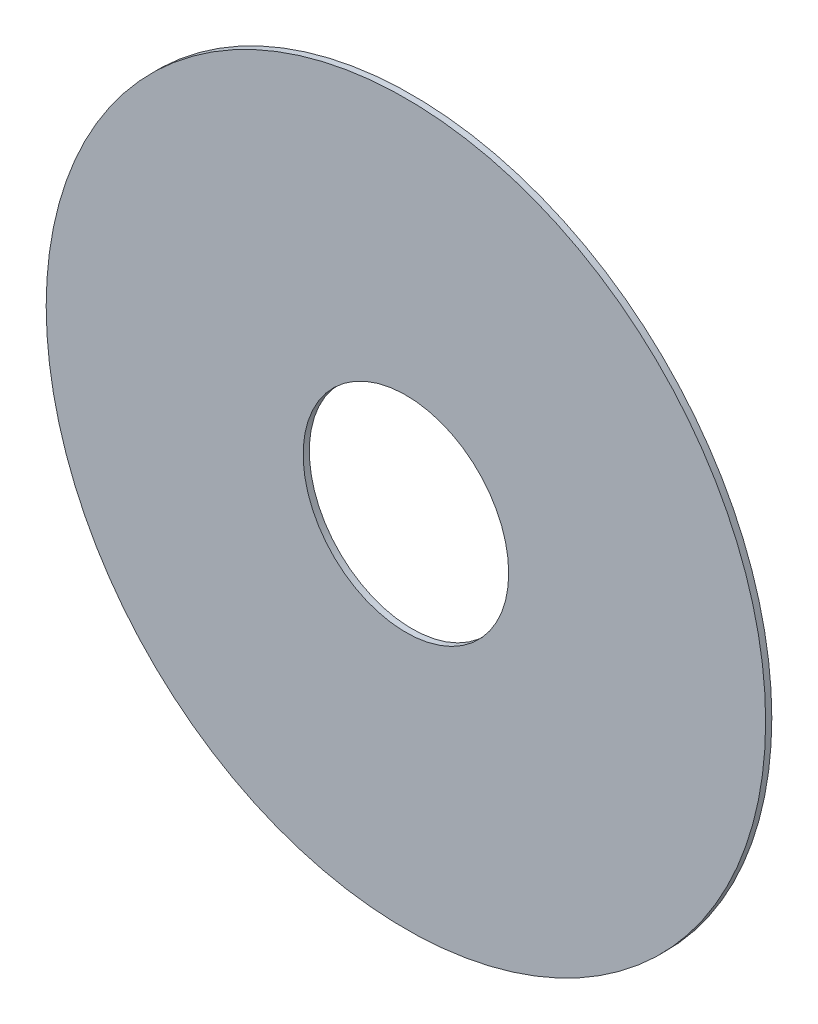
ISO-10303-21;
HEADER;
FILE_DESCRIPTION(('STEP AP214'),'2;1');
FILE_NAME('part.step','',(''),(''),'','','');
FILE_SCHEMA(('AUTOMOTIVE_DESIGN { 1 0 10303 214 1 1 1 1 }'));
ENDSEC;
DATA;
#1=APPLICATION_CONTEXT('core data for automotive mechanical design processes');
#2=APPLICATION_PROTOCOL_DEFINITION('international standard','automotive_design',2000,#1);
#3=PRODUCT_CONTEXT('',#1,'mechanical');
#4=PRODUCT('Part','Part','',(#3));
#5=PRODUCT_RELATED_PRODUCT_CATEGORY('part','',(#4));
#6=PRODUCT_DEFINITION_FORMATION('','',#4);
#7=PRODUCT_DEFINITION_CONTEXT('part definition',#1,'design');
#8=PRODUCT_DEFINITION('design','',#6,#7);
#9=PRODUCT_DEFINITION_SHAPE('','',#8);
#10=(LENGTH_UNIT() NAMED_UNIT(*) SI_UNIT(.MILLI.,.METRE.));
#11=(NAMED_UNIT(*) PLANE_ANGLE_UNIT() SI_UNIT($,.RADIAN.));
#12=(NAMED_UNIT(*) SI_UNIT($,.STERADIAN.) SOLID_ANGLE_UNIT());
#13=UNCERTAINTY_MEASURE_WITH_UNIT(LENGTH_MEASURE(1.E-05),#10,'distance_accuracy_value','');
#14=(GEOMETRIC_REPRESENTATION_CONTEXT(3) GLOBAL_UNCERTAINTY_ASSIGNED_CONTEXT((#13)) GLOBAL_UNIT_ASSIGNED_CONTEXT((#10,
#11,#12)) REPRESENTATION_CONTEXT('',''));
#15=CARTESIAN_POINT('',(0.,0.,0.));
#16=DIRECTION('',(0.,0.,1.));
#17=DIRECTION('',(1.,0.,0.));
#18=AXIS2_PLACEMENT_3D('',#15,#16,#17);
#19=CARTESIAN_POINT('',(0.,0.,1.524));
#20=DIRECTION('',(0.,0.,-1.));
#21=DIRECTION('',(-1.,0.,0.));
#22=AXIS2_PLACEMENT_3D('',#19,#20,#21);
#23=CYLINDRICAL_SURFACE('',#22,88.9);
#24=CARTESIAN_POINT('',(0.,0.,1.524));
#25=DIRECTION('',(0.,0.,1.));
#26=DIRECTION('',(1.,0.,0.));
#27=AXIS2_PLACEMENT_3D('',#24,#25,#26);
#28=CIRCLE('',#27,88.9);
#29=CARTESIAN_POINT('',(88.9,0.,1.524));
#30=VERTEX_POINT('',#29);
#31=EDGE_CURVE('E10',#30,#30,#28,.T.);
#32=ORIENTED_EDGE('',*,*,#31,.F.);
#33=EDGE_LOOP('',(#32));
#34=FACE_BOUND('',#33,.T.);
#35=CARTESIAN_POINT('',(0.,0.,0.));
#36=DIRECTION('',(0.,0.,1.));
#37=DIRECTION('',(1.,0.,0.));
#38=AXIS2_PLACEMENT_3D('',#35,#36,#37);
#39=CIRCLE('',#38,88.9);
#40=CARTESIAN_POINT('',(88.9,0.,0.));
#41=VERTEX_POINT('',#40);
#42=EDGE_CURVE('E33',#41,#41,#39,.T.);
#43=ORIENTED_EDGE('',*,*,#42,.T.);
#44=EDGE_LOOP('',(#43));
#45=FACE_BOUND('',#44,.T.);
#46=ADVANCED_FACE('F30',(#34,#45),#23,.T.);
#47=CARTESIAN_POINT('',(0.,0.,1.524));
#48=DIRECTION('',(0.,0.,1.));
#49=DIRECTION('',(1.,0.,0.));
#50=AXIS2_PLACEMENT_3D('',#47,#48,#49);
#51=PLANE('',#50);
#52=CARTESIAN_POINT('',(0.,0.,1.524));
#53=DIRECTION('',(0.,0.,1.));
#54=DIRECTION('',(1.,0.,0.));
#55=AXIS2_PLACEMENT_3D('',#52,#53,#54);
#56=CIRCLE('',#55,25.4);
#57=CARTESIAN_POINT('',(25.4,0.,1.524));
#58=VERTEX_POINT('',#57);
#59=EDGE_CURVE('E42',#58,#58,#56,.T.);
#60=ORIENTED_EDGE('',*,*,#59,.F.);
#61=EDGE_LOOP('',(#60));
#62=FACE_BOUND('',#61,.T.);
#63=ORIENTED_EDGE('',*,*,#31,.T.);
#64=EDGE_LOOP('',(#63));
#65=FACE_BOUND('',#64,.T.);
#66=ADVANCED_FACE('F57',(#62,#65),#51,.T.);
#67=CARTESIAN_POINT('',(0.,0.,0.));
#68=DIRECTION('',(0.,0.,1.));
#69=DIRECTION('',(1.,0.,0.));
#70=AXIS2_PLACEMENT_3D('',#67,#68,#69);
#71=PLANE('',#70);
#72=CARTESIAN_POINT('',(0.,0.,0.));
#73=DIRECTION('',(0.,0.,1.));
#74=DIRECTION('',(1.,0.,0.));
#75=AXIS2_PLACEMENT_3D('',#72,#73,#74);
#76=CIRCLE('',#75,25.4);
#77=CARTESIAN_POINT('',(25.4,0.,0.));
#78=VERTEX_POINT('',#77);
#79=EDGE_CURVE('E40',#78,#78,#76,.T.);
#80=ORIENTED_EDGE('',*,*,#79,.T.);
#81=EDGE_LOOP('',(#80));
#82=FACE_BOUND('',#81,.T.);
#83=ORIENTED_EDGE('',*,*,#42,.F.);
#84=EDGE_LOOP('',(#83));
#85=FACE_BOUND('',#84,.T.);
#86=ADVANCED_FACE('F48',(#82,#85),#71,.F.);
#87=CARTESIAN_POINT('',(0.,0.,0.));
#88=DIRECTION('',(0.,0.,1.));
#89=DIRECTION('',(1.,0.,0.));
#90=AXIS2_PLACEMENT_3D('',#87,#88,#89);
#91=CYLINDRICAL_SURFACE('',#90,25.4);
#92=ORIENTED_EDGE('',*,*,#79,.F.);
#93=EDGE_LOOP('',(#92));
#94=FACE_BOUND('',#93,.T.);
#95=ORIENTED_EDGE('',*,*,#59,.T.);
#96=EDGE_LOOP('',(#95));
#97=FACE_BOUND('',#96,.T.);
#98=ADVANCED_FACE('F51',(#94,#97),#91,.F.);
#99=CLOSED_SHELL('',(#46,#66,#86,#98));
#100=MANIFOLD_SOLID_BREP('B2',#99);
#101=ADVANCED_BREP_SHAPE_REPRESENTATION('',(#18,#100),#14);
#102=SHAPE_DEFINITION_REPRESENTATION(#9,#101);
ENDSEC;
END-ISO-10303-21;
